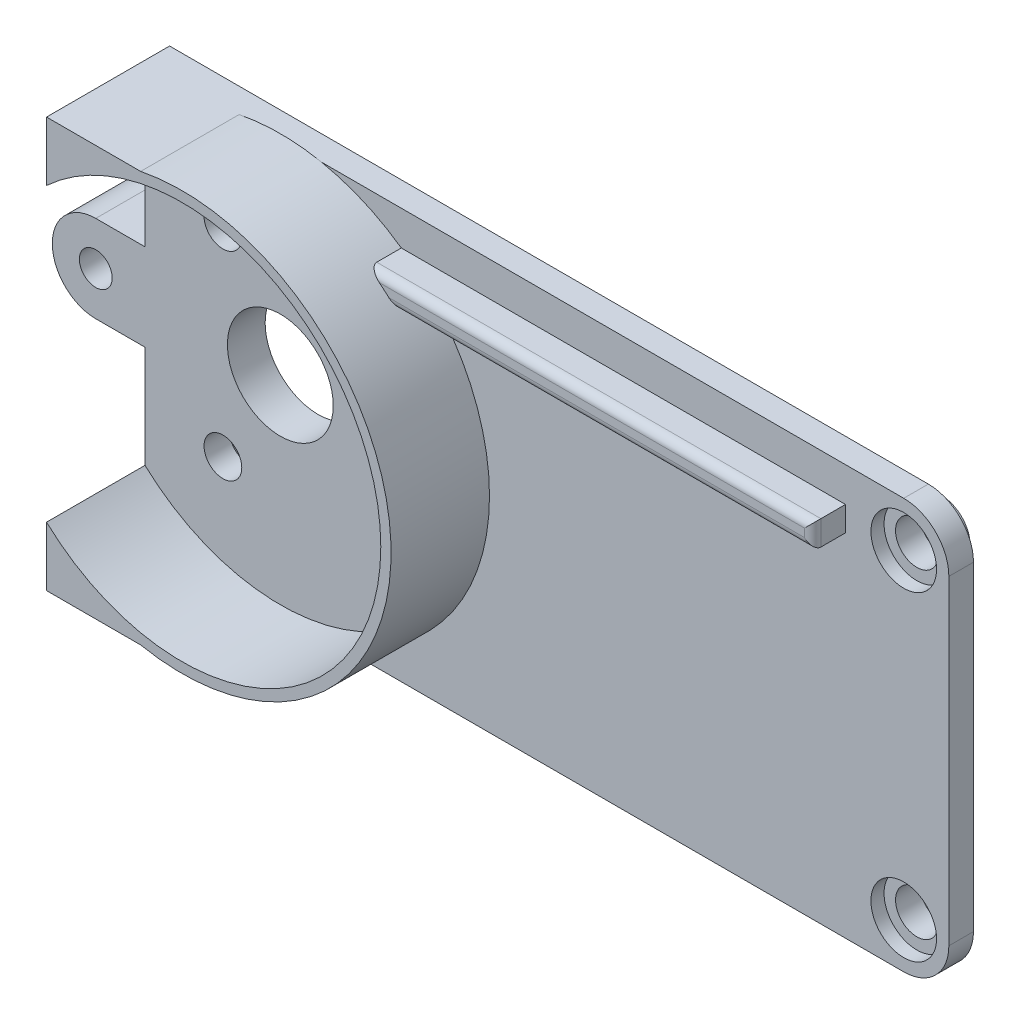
from build123d import *

# Parameters (mm, degrees)
ESQUISSE1_W             = 49
ESQUISSE1_H             = 25
EXTRUSION1_DEPTH        = 2.3
EXTRUSION2_DEPTH        = 6
CONG_1_R                = 2.75
ESQUISSE3_R             = 3.225
ESQUISSE3_R_2           = 1.15
ESQUISSE3_R_3           = 1.3
ENL_V_MAT_EXTRU_1_DEPTH = 6
EXTRUSION3_DEPTH        = 2
CONG_2_R                = 0.5
ESQUISSE5_R             = 3
ESQUISSE5_R_2           = 1.525
EXTRUSION4_DEPTH        = 1.5
ENL_V_START             = -3
ESQUISSE6_R             = 1.525
ENL_V_MAT_EXTRU_2_DEPTH = 3
ESQUISSE7_R             = 2.5
ESQUISSE7_R_2           = 1.575
EXTRUSION5_DEPTH        = 3.8
ENL_V_START_2           = -4.5
ESQUISSE8_R             = 1.575
ENL_V_MAT_EXTRU_3_DEPTH = 4.5
ESQUISSE9_OUTSIDE_W     = 62.31
ESQUISSE9_OUTSIDE_H     = 38.81
ENL_V_MAT_EXTRU_4_DEPTH = 0.8
CHANFREIN1_SIZE         = 0.75
ESQUISSE10_R            = 1
EXTRUSION6_DEPTH        = 5.8
ESQUISSE11_R            = 2
ENL_V_MAT_EXTRU_5_DEPTH = 0.8


with BuildPart() as part:
    # Esquisse1 → Extrusion1 (new body)
    with BuildSketch(Plane.XY):
        with Locations((24.5, 12.5)):
            Rectangle(ESQUISSE1_W, ESQUISSE1_H)
    extrude(amount=EXTRUSION1_DEPTH)

    # Esquisse2 → Extrusion2 (add)
    with BuildSketch(Plane.XY.offset(2.3)):
        with BuildLine():
            Line((0, 25), (5.737531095, 25))
            ThreePointArc((5.737531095, 25), (21, 12.5), (5.737531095, 0))
            Line((5.737531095, 0), (0, 0))
            Line((0, 0), (0, 3.614442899))
            ThreePointArc((0, 3.614442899), (20.375, 12.5), (0, 21.385557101))
            Line((0, 21.385557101), (0, 25))
        make_face()
    extrude(amount=EXTRUSION2_DEPTH)

    # Cong_1
    cong_1_edges = [part.edges().sort_by_distance(p)[0] for p in [
        (49, 25, 1.15),
        (49, 0, 1.15),
    ]]
    fillet(cong_1_edges, radius=CONG_1_R)

    # Esquisse3 → Enl_v. mat.-Extru.1 (cut)
    with BuildSketch(Plane.XY.offset(2.3)):
        with Locations((8.25, 12.5)):
            Circle(ESQUISSE3_R)
        with Locations((4.75, 18.562177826)):
            Circle(ESQUISSE3_R_2)
        with Locations((4.75, 6.437822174)):
            Circle(ESQUISSE3_R_2)
        with Locations((15.25, 12.5)):
            Circle(ESQUISSE3_R_2)
        with Locations((46.25, 22.25)):
            Circle(ESQUISSE3_R_3)
        with Locations((46.25, 2.75)):
            Circle(ESQUISSE3_R_3)
    extrude(amount=-ENL_V_MAT_EXTRU_1_DEPTH, mode=Mode.SUBTRACT)

    # Esquisse4 → Extrusion3 (add)
    with BuildSketch(Plane.XY.offset(2.3)):
        with BuildLine():
            Line((15.625805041, 22.9), (42.7, 22.9))
            Line((42.7, 22.9), (42.7, 21.4))
            Line((42.7, 21.4), (17.379759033, 21.4))
            ThreePointArc((17.379759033, 21.4), (16.536791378, 22.189767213), (15.625805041, 22.9))
        make_face()
    extrude(amount=EXTRUSION3_DEPTH)

    # Cong_2
    cong_2_edges = [part.edges().sort_by_distance(p)[0] for p in [
        (42.7, 22.15, 4.3),
        (29.16290252, 22.9, 4.3),
        (30.039879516, 21.4, 4.3),
    ]]
    fillet(cong_2_edges, radius=CONG_2_R)

    # Esquisse5 → Extrusion4 (add)
    with BuildSketch(Plane(origin=(0, 0, 0), x_dir=(-1, 0, 0), z_dir=(0, 0, -1))):
        with Locations((-22.35, 12.5)):
            Circle(ESQUISSE5_R)
        with Locations((-22.35, 12.5)):
            Circle(ESQUISSE5_R_2, mode=Mode.SUBTRACT)
    extrude(amount=EXTRUSION4_DEPTH)

    # Esquisse6 → Enl_v. mat.-Extru.2 (cut)
    with BuildSketch(Plane(origin=(0, 0, -1.5), x_dir=(-1, 0, 0), z_dir=(0, 0, -1)).offset(ENL_V_START)):
        with Locations((-22.35, 12.5)):
            Circle(ESQUISSE6_R)
    extrude(amount=ENL_V_MAT_EXTRU_2_DEPTH, mode=Mode.SUBTRACT)

    # Esquisse7 → Extrusion5 (add)
    with BuildSketch(Plane(origin=(0, 0, 0), x_dir=(-1, 0, 0), z_dir=(0, 0, -1))):
        with Locations(Location((-36.45, 12.5, 0), (0, 0, 180))):
            Circle(ESQUISSE7_R)
        with Locations(Location((-36.45, 12.5, 0), (0, 0, 180))):
            Circle(ESQUISSE7_R_2, mode=Mode.SUBTRACT)
    extrude(amount=EXTRUSION5_DEPTH)

    # Esquisse8 → Enl_v. mat.-Extru.3 (cut)
    with BuildSketch(Plane(origin=(0, 0, -3.8), x_dir=(-1, 0, 0), z_dir=(0, 0, -1)).offset(ENL_V_START_2)):
        with Locations(Location((-36.45, 12.5, 0), (0, 0, 180))):
            Circle(ESQUISSE8_R)
    extrude(amount=ENL_V_MAT_EXTRU_3_DEPTH, mode=Mode.SUBTRACT)

    # Esquisse9 outside → Enl_v. mat.-Extru.4 (cut)
    with BuildSketch(Plane(origin=(0, 0, 0), x_dir=(-1, 0, 0), z_dir=(0, 0, -1))):
        with Locations((-24.5, 12.5)):
            Rectangle(ESQUISSE9_OUTSIDE_W, ESQUISSE9_OUTSIDE_H)
        with BuildLine():
            Line((-1, 24), (-46.25, 24))
            ThreePointArc((-46.25, 24), (-47.487436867, 23.487436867), (-48, 22.25))
            Line((-48, 22.25), (-48, 2.75))
            ThreePointArc((-48, 2.75), (-47.487436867, 1.512563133), (-46.25, 1))
            Line((-46.25, 1), (-1, 1))
            Line((-1, 1), (-1, 24))
        make_face(mode=Mode.SUBTRACT)
    extrude(amount=-ENL_V_MAT_EXTRU_4_DEPTH, mode=Mode.SUBTRACT)

    # Chanfrein1
    chanfrein1_edges = [part.edges().sort_by_distance(p)[0] for p in [
        (3.6, 18.562177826, 0),
        (3.6, 6.437822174, 0),
        (14.1, 12.5, 0),
    ]]
    chamfer(chanfrein1_edges, length=CHANFREIN1_SIZE)

    # Esquisse10 → Extrusion6 (add)
    with BuildSketch(Plane.XY.offset(2.3)):
        with BuildLine():
            Line((-3, 15.15), (0, 15.15))
            Line((0, 15.15), (0, 9.85))
            Line((0, 9.85), (-3, 9.85))
            ThreePointArc((-3, 9.85), (-5.65, 12.5), (-3, 15.15))
        make_face()
        with Locations((-3, 12.5)):
            Circle(ESQUISSE10_R, mode=Mode.SUBTRACT)
    extrude(amount=-EXTRUSION6_DEPTH)

    # Esquisse11 → Enl_v. mat.-Extru.5 (cut)
    with BuildSketch(Plane.XY.offset(2.3)):
        with Locations((46.25, 22.25)):
            Circle(ESQUISSE11_R)
        with Locations((46.25, 2.75)):
            Circle(ESQUISSE11_R)
    extrude(amount=-ENL_V_MAT_EXTRU_5_DEPTH, mode=Mode.SUBTRACT)


solid = part.part
